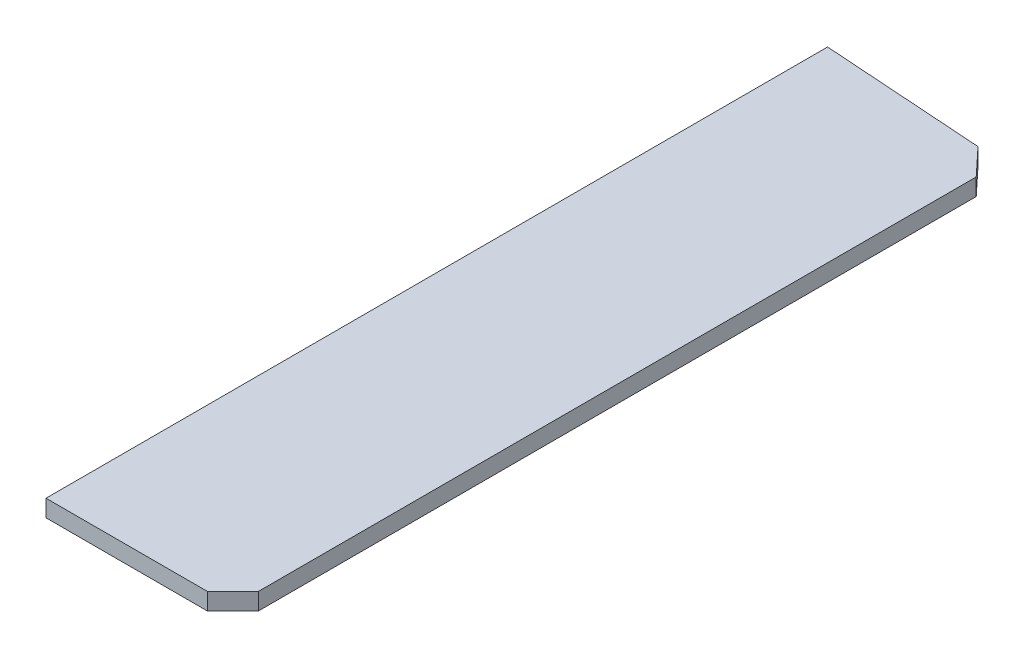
from build123d import *

# Parameters (mm, degrees)
BOSS_EXTRUDE1_DEPTH = 6.35


with BuildPart() as part:
    # Sketch1 → Boss-Extrude1 (new body)
    with BuildSketch(Plane(origin=(0, 0, 0), x_dir=(1, 0, 0), z_dir=(0, 1, 0))):
        Polygon((0, 292.1), (60.347062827, 287.985427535), (69.85, 277.8125), (69.85, 9.525), (60.325, 0), (0, 0), align=None)
    extrude(amount=BOSS_EXTRUDE1_DEPTH)


solid = part.part
